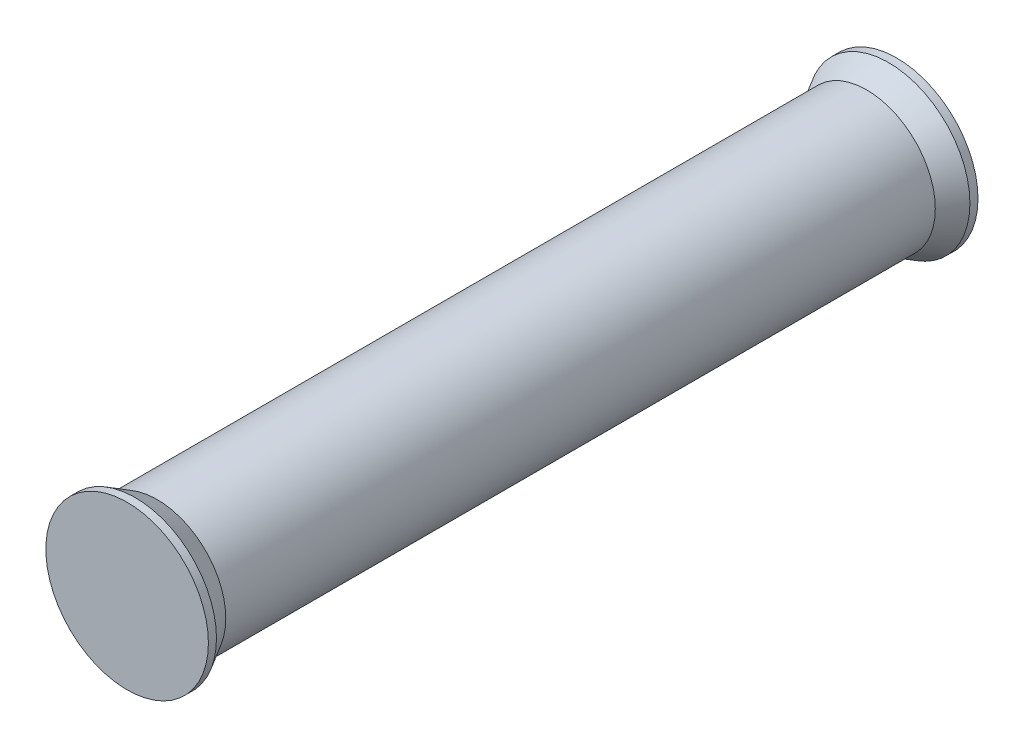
ISO-10303-21;
HEADER;
FILE_DESCRIPTION(('STEP AP214'),'2;1');
FILE_NAME('part.step','',(''),(''),'','','');
FILE_SCHEMA(('AUTOMOTIVE_DESIGN { 1 0 10303 214 1 1 1 1 }'));
ENDSEC;
DATA;
#1=APPLICATION_CONTEXT('core data for automotive mechanical design processes');
#2=APPLICATION_PROTOCOL_DEFINITION('international standard','automotive_design',2000,#1);
#3=PRODUCT_CONTEXT('',#1,'mechanical');
#4=PRODUCT('Part','Part','',(#3));
#5=PRODUCT_RELATED_PRODUCT_CATEGORY('part','',(#4));
#6=PRODUCT_DEFINITION_FORMATION('','',#4);
#7=PRODUCT_DEFINITION_CONTEXT('part definition',#1,'design');
#8=PRODUCT_DEFINITION('design','',#6,#7);
#9=PRODUCT_DEFINITION_SHAPE('','',#8);
#10=(LENGTH_UNIT() NAMED_UNIT(*) SI_UNIT(.MILLI.,.METRE.));
#11=(NAMED_UNIT(*) PLANE_ANGLE_UNIT() SI_UNIT($,.RADIAN.));
#12=(NAMED_UNIT(*) SI_UNIT($,.STERADIAN.) SOLID_ANGLE_UNIT());
#13=UNCERTAINTY_MEASURE_WITH_UNIT(LENGTH_MEASURE(1.E-05),#10,'distance_accuracy_value','');
#14=(GEOMETRIC_REPRESENTATION_CONTEXT(3) GLOBAL_UNCERTAINTY_ASSIGNED_CONTEXT((#13)) GLOBAL_UNIT_ASSIGNED_CONTEXT((#10,
#11,#12)) REPRESENTATION_CONTEXT('',''));
#15=CARTESIAN_POINT('',(0.,0.,0.));
#16=DIRECTION('',(0.,0.,1.));
#17=DIRECTION('',(1.,0.,0.));
#18=AXIS2_PLACEMENT_3D('',#15,#16,#17);
#19=CARTESIAN_POINT('',(0.,5.15619999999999,0.));
#20=DIRECTION('',(0.,0.,-1.));
#21=DIRECTION('',(-1.,0.,0.));
#22=AXIS2_PLACEMENT_3D('',#19,#20,#21);
#23=PLANE('',#22);
#24=CARTESIAN_POINT('',(0.,0.,0.));
#25=DIRECTION('',(0.,0.,1.));
#26=DIRECTION('',(1.,0.,0.));
#27=AXIS2_PLACEMENT_3D('',#24,#25,#26);
#28=CIRCLE('',#27,5.15619999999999);
#29=CARTESIAN_POINT('',(5.15619999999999,0.,0.));
#30=VERTEX_POINT('',#29);
#31=EDGE_CURVE('E57',#30,#30,#28,.T.);
#32=ORIENTED_EDGE('',*,*,#31,.T.);
#33=EDGE_LOOP('',(#32));
#34=FACE_BOUND('',#33,.T.);
#35=ADVANCED_FACE('F35',(#34),#23,.F.);
#36=CARTESIAN_POINT('',(0.,0.,-48.8188));
#37=DIRECTION('',(0.,0.,1.));
#38=DIRECTION('',(1.,0.,0.));
#39=AXIS2_PLACEMENT_3D('',#36,#37,#38);
#40=PLANE('',#39);
#41=CARTESIAN_POINT('',(0.,0.,-48.8188));
#42=DIRECTION('',(0.,0.,1.));
#43=DIRECTION('',(1.,0.,0.));
#44=AXIS2_PLACEMENT_3D('',#41,#42,#43);
#45=CIRCLE('',#44,5.1562);
#46=CARTESIAN_POINT('',(5.1562,0.,-48.8188));
#47=VERTEX_POINT('',#46);
#48=EDGE_CURVE('E10',#47,#47,#45,.T.);
#49=ORIENTED_EDGE('',*,*,#48,.F.);
#50=EDGE_LOOP('',(#49));
#51=FACE_BOUND('',#50,.T.);
#52=ADVANCED_FACE('F87',(#51),#40,.F.);
#53=CARTESIAN_POINT('',(0.,0.,0.));
#54=DIRECTION('',(0.,0.,1.));
#55=DIRECTION('',(1.,0.,0.));
#56=AXIS2_PLACEMENT_3D('',#53,#54,#55);
#57=CYLINDRICAL_SURFACE('',#56,5.1562);
#58=CARTESIAN_POINT('',(0.,0.,-48.3062129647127));
#59=DIRECTION('',(0.,0.,1.));
#60=DIRECTION('',(1.,0.,0.));
#61=AXIS2_PLACEMENT_3D('',#58,#59,#60);
#62=CIRCLE('',#61,5.1562);
#63=CARTESIAN_POINT('',(5.1562,0.,-48.3062129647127));
#64=VERTEX_POINT('',#63);
#65=EDGE_CURVE('E41',#64,#64,#62,.T.);
#66=ORIENTED_EDGE('',*,*,#65,.F.);
#67=EDGE_LOOP('',(#66));
#68=FACE_BOUND('',#67,.T.);
#69=ORIENTED_EDGE('',*,*,#48,.T.);
#70=EDGE_LOOP('',(#69));
#71=FACE_BOUND('',#70,.T.);
#72=ADVANCED_FACE('F82',(#68,#71),#57,.T.);
#73=CARTESIAN_POINT('',(0.,0.,-48.3062129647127));
#74=DIRECTION('',(0.,0.,-1.));
#75=DIRECTION('',(-1.,0.,0.));
#76=AXIS2_PLACEMENT_3D('',#73,#74,#75);
#77=CONICAL_SURFACE('',#76,5.1562,0.523598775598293);
#78=CARTESIAN_POINT('',(0.,0.,-46.9138));
#79=DIRECTION('',(0.,0.,1.));
#80=DIRECTION('',(1.,0.,0.));
#81=AXIS2_PLACEMENT_3D('',#78,#79,#80);
#82=CIRCLE('',#81,4.35229);
#83=CARTESIAN_POINT('',(4.35229,0.,-46.9138));
#84=VERTEX_POINT('',#83);
#85=EDGE_CURVE('E45',#84,#84,#82,.T.);
#86=ORIENTED_EDGE('',*,*,#85,.F.);
#87=EDGE_LOOP('',(#86));
#88=FACE_BOUND('',#87,.T.);
#89=ORIENTED_EDGE('',*,*,#65,.T.);
#90=EDGE_LOOP('',(#89));
#91=FACE_BOUND('',#90,.T.);
#92=ADVANCED_FACE('F77',(#88,#91),#77,.T.);
#93=CARTESIAN_POINT('',(0.,0.,0.));
#94=DIRECTION('',(0.,0.,1.));
#95=DIRECTION('',(1.,0.,0.));
#96=AXIS2_PLACEMENT_3D('',#93,#94,#95);
#97=CYLINDRICAL_SURFACE('',#96,4.35229);
#98=CARTESIAN_POINT('',(0.,0.,-1.905));
#99=DIRECTION('',(0.,0.,1.));
#100=DIRECTION('',(1.,0.,0.));
#101=AXIS2_PLACEMENT_3D('',#98,#99,#100);
#102=CIRCLE('',#101,4.35228999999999);
#103=CARTESIAN_POINT('',(4.35228999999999,0.,-1.905));
#104=VERTEX_POINT('',#103);
#105=EDGE_CURVE('E49',#104,#104,#102,.T.);
#106=ORIENTED_EDGE('',*,*,#105,.F.);
#107=EDGE_LOOP('',(#106));
#108=FACE_BOUND('',#107,.T.);
#109=ORIENTED_EDGE('',*,*,#85,.T.);
#110=EDGE_LOOP('',(#109));
#111=FACE_BOUND('',#110,.T.);
#112=ADVANCED_FACE('F71',(#108,#111),#97,.T.);
#113=CARTESIAN_POINT('',(0.,0.,-1.905));
#114=DIRECTION('',(0.,0.,1.));
#115=DIRECTION('',(1.,0.,0.));
#116=AXIS2_PLACEMENT_3D('',#113,#114,#115);
#117=CONICAL_SURFACE('',#116,4.35228999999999,0.523598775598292);
#118=CARTESIAN_POINT('',(0.,0.,-0.512587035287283));
#119=DIRECTION('',(0.,0.,1.));
#120=DIRECTION('',(1.,0.,0.));
#121=AXIS2_PLACEMENT_3D('',#118,#119,#120);
#122=CIRCLE('',#121,5.15619999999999);
#123=CARTESIAN_POINT('',(5.15619999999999,0.,-0.512587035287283));
#124=VERTEX_POINT('',#123);
#125=EDGE_CURVE('E54',#124,#124,#122,.T.);
#126=ORIENTED_EDGE('',*,*,#125,.F.);
#127=EDGE_LOOP('',(#126));
#128=FACE_BOUND('',#127,.T.);
#129=ORIENTED_EDGE('',*,*,#105,.T.);
#130=EDGE_LOOP('',(#129));
#131=FACE_BOUND('',#130,.T.);
#132=ADVANCED_FACE('F65',(#128,#131),#117,.T.);
#133=CARTESIAN_POINT('',(0.,0.,0.));
#134=DIRECTION('',(0.,0.,1.));
#135=DIRECTION('',(1.,0.,0.));
#136=AXIS2_PLACEMENT_3D('',#133,#134,#135);
#137=CYLINDRICAL_SURFACE('',#136,5.15619999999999);
#138=ORIENTED_EDGE('',*,*,#31,.F.);
#139=EDGE_LOOP('',(#138));
#140=FACE_BOUND('',#139,.T.);
#141=ORIENTED_EDGE('',*,*,#125,.T.);
#142=EDGE_LOOP('',(#141));
#143=FACE_BOUND('',#142,.T.);
#144=ADVANCED_FACE('F62',(#140,#143),#137,.T.);
#145=CLOSED_SHELL('',(#35,#52,#72,#92,#112,#132,#144));
#146=MANIFOLD_SOLID_BREP('B2',#145);
#147=ADVANCED_BREP_SHAPE_REPRESENTATION('',(#18,#146),#14);
#148=SHAPE_DEFINITION_REPRESENTATION(#9,#147);
ENDSEC;
END-ISO-10303-21;
